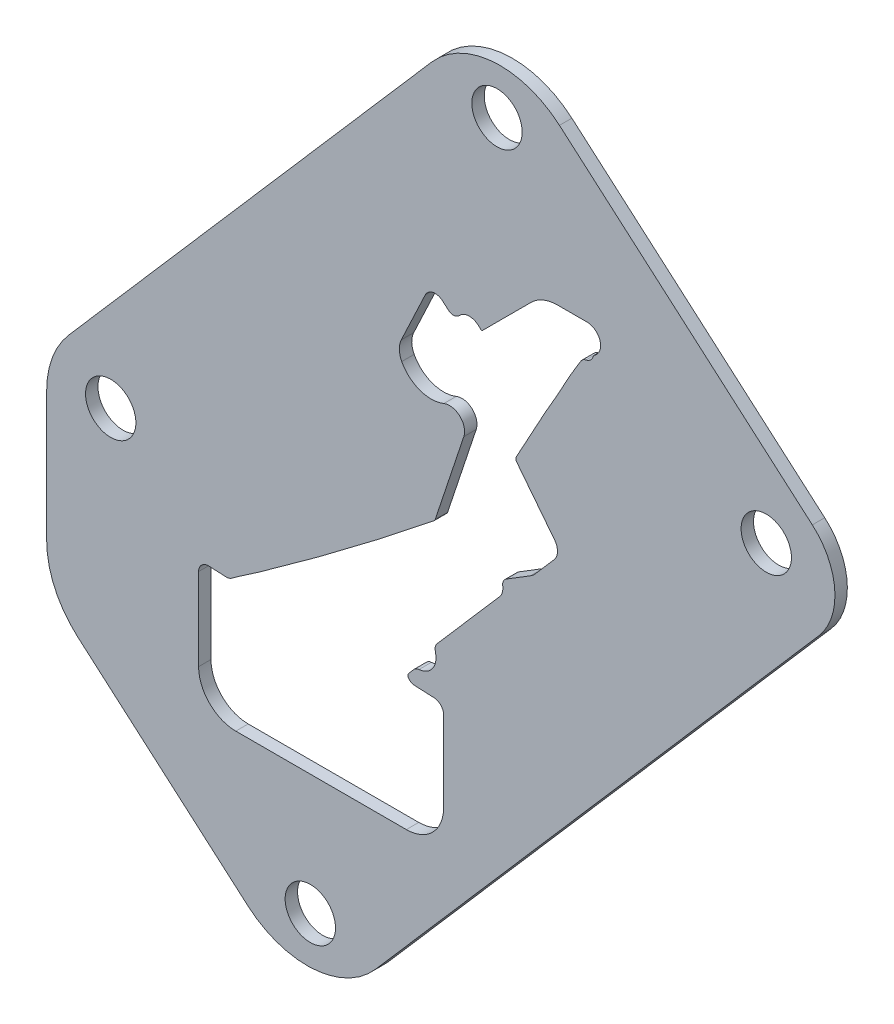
from build123d import *

# Parameters (mm, degrees)
BOSS_EXTRUDE1_DEPTH                            = 2.54
HOLE1_D                                        = 10.3124
CUT_EXTRUDE1_QU250515L_PUNCH26_MOUNTED_I_DEPTH = 456.267668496
FILLET1_R                                      = 1.5875
FILLET2_R                                      = 0.79375


with BuildPart() as part:
    # Sketch2 → Boss-Extrude1 (new body)
    with BuildSketch(Plane.XY.offset(-29.21)):
        with BuildLine():
            Line((-277.670813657, -6.122873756), (-329.450777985, 38.844355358))
            ThreePointArc((-329.450777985, 38.844355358), (-342.911048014, 43.340785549), (-355.608352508, 37.002393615))
            Line((-355.608352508, 37.002393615), (-429.924768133, -48.573289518))
            ThreePointArc((-429.924768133, -48.573289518), (-433.294361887, -54.241794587), (-434.467, -60.731095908))
            Line((-434.467, -60.731095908), (-434.467, -87.232348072))
            ThreePointArc((-434.467, -87.232348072), (-432.795622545, -94.925712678), (-428.08280639, -101.232116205))
            Line((-428.08280639, -101.232116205), (-393.258258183, -131.474768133))
            ThreePointArc((-393.258258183, -131.474768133), (-379.797988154, -135.971198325), (-367.10068366, -129.63280639))
            Line((-367.10068366, -129.63280639), (-276.333498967, -25.113989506))
            ThreePointArc((-276.333498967, -25.113989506), (-273.068967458, -15.34146469), (-277.670813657, -6.122873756))
        make_face()
    extrude(amount=-BOSS_EXTRUDE1_DEPTH)

    # Hole1 (through all)
    with Locations(Plane(origin=(-324.575695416, -14.460479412, -29.21), x_dir=(1, 0, 0), z_dir=(0, 0, 1))):
        with Locations((-17.663697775, 48.263140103), (37.472375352, 0.381368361), (-55.893947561, -111.972594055), (-96.772711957, -42.831241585)):
            Hole(HOLE1_D / 2)

    # Sketch1 QU250515L_Punch26_Mounted in the → Cut-Extrude1 QU250515L_Punch26_Mounted i (cut, through all)
    with BuildSketch(Plane.XY.offset(-29.21)):
        with BuildLine():
            Line((-323.821484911, 6.778771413), (-329.866864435, 6.778771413))
            ThreePointArc((-329.866864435, 6.778771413), (-332.78291219, 6.19873345), (-335.255018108, 4.546925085))
            Line((-335.255018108, 4.546925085), (-345.215586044, -5.413642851))
            ThreePointArc((-345.215586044, -5.413642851), (-345.395191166, -5.488037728), (-345.574796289, -5.413642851))
            Line((-345.574796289, -5.413642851), (-345.934006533, -5.054432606))
            ThreePointArc((-345.934006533, -5.054432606), (-348.787119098, -4.377447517), (-350.673739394, -6.622269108))
            Line((-350.673739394, -6.622269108), (-353.407010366, -4.24861699))
            ThreePointArc((-353.407010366, -4.24861699), (-355.364066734, -3.741437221), (-356.949396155, -4.996041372))
            Line((-356.949396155, -4.996041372), (-361.837583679, -15.384297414))
            ThreePointArc((-361.837583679, -15.384297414), (-362.242427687, -17.300618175), (-361.748332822, -19.195889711))
            ThreePointArc((-361.748332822, -19.195889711), (-358.039982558, -22.424186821), (-353.124227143, -22.328726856))
            ThreePointArc((-353.124227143, -22.328726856), (-349.856493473, -22.93175598), (-349.038318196, -26.152364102))
            Line((-349.038318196, -26.152364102), (-354.89302927, -43.761492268))
            ThreePointArc((-354.89302927, -43.761492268), (-354.985978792, -43.947326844), (-355.127519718, -44.099446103))
            ThreePointArc((-355.127519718, -44.099446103), (-372.805833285, -57.892237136), (-390.917601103, -71.110698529))
            Line((-390.917601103, -71.110698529), (-394.79394731, -73.76324236))
            ThreePointArc((-394.79394731, -73.76324236), (-395.699416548, -74.404443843), (-396.603513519, -75.047578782))
            ThreePointArc((-396.603513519, -75.047578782), (-397.133844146, -75.305564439), (-397.719388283, -75.375886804))
            Line((-397.719388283, -75.375886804), (-401.224344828, -75.210709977))
            ThreePointArc((-401.224344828, -75.210709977), (-402.722614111, -75.770185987), (-403.352, -77.240457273))
            Line((-403.352, -77.240457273), (-403.352, -94.107))
            ThreePointArc((-403.352, -94.107), (-401.120153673, -99.495153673), (-395.732, -101.727))
            Line((-395.732, -101.727), (-360.807, -101.727))
            ThreePointArc((-360.807, -101.727), (-355.418846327, -99.495153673), (-353.187, -94.107))
            Line((-353.187, -94.107), (-353.187, -77.539711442))
            ThreePointArc((-353.187, -77.539711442), (-353.748728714, -76.13709733), (-355.123344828, -75.509964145))
            Line((-355.123344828, -75.509964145), (-359.690046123, -75.294750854))
            Line((-359.690046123, -75.294750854), (-360.803075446, -74.328163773))
            Line((-360.803075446, -74.328163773), (-358.817373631, -72.041621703))
            ThreePointArc((-358.817373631, -72.041621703), (-355.791659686, -70.898544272), (-354.765382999, -67.831244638))
            Line((-354.765382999, -67.831244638), (-354.822446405, -67.359859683))
            ThreePointArc((-354.822446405, -67.359859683), (-354.928120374, -66.820436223), (-355.111111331, -66.302112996))
            Line((-355.111111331, -66.302112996), (-341.724092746, -50.886898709))
            ThreePointArc((-341.724092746, -50.886898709), (-341.055395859, -49.351137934), (-341.385232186, -47.708906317))
            Line((-341.385232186, -47.708906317), (-335.420274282, -44.028615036))
            ThreePointArc((-335.420274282, -44.028615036), (-334.876281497, -43.633200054), (-334.398168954, -43.160241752))
            Line((-334.398168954, -43.160241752), (-330.541734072, -38.719539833))
            ThreePointArc((-330.541734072, -38.719539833), (-329.858210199, -36.959315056), (-330.450427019, -35.166307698))
            Line((-330.450427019, -35.166307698), (-338.24577182, -25.198765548))
            ThreePointArc((-338.24577182, -25.198765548), (-338.398298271, -24.808731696), (-338.311367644, -24.399056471))
            Line((-338.311367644, -24.399056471), (-332.466908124, -13.701521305))
            Line((-332.466908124, -13.701521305), (-329.884539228, -9.204578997))
            Line((-329.884539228, -9.204578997), (-327.710288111, -5.224890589))
            ThreePointArc((-327.710288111, -5.224890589), (-327.498770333, -4.846173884), (-327.285490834, -4.468446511))
            ThreePointArc((-327.285490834, -4.468446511), (-327.06690102, -4.094805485), (-326.843935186, -3.723759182))
            ThreePointArc((-326.843935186, -3.723759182), (-325.754794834, -1.898952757), (-324.6361989, -0.092052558))
            ThreePointArc((-324.6361989, -0.092052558), (-324.573174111, -0.078041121), (-324.508627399, -0.076569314))
            ThreePointArc((-324.508627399, -0.076569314), (-323.410084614, 0.18465492), (-322.66546519, 1.033522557))
            ThreePointArc((-322.66546519, 1.033522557), (-322.565757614, 1.260559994), (-322.464972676, 1.487121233))
            ThreePointArc((-322.464972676, 1.487121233), (-322.423803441, 1.551158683), (-322.365506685, 1.600119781))
            ThreePointArc((-322.365506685, 1.600119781), (-321.131768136, 4.74098545), (-323.821484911, 6.778771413))
        make_face()
    extrude(amount=-CUT_EXTRUDE1_QU250515L_PUNCH26_MOUNTED_I_DEPTH, mode=Mode.SUBTRACT)

    # Fillet1
    fillet1_edges = [part.edges().sort_by_distance(p)[0] for p in [
        (-355.111111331, -66.302112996, -30.48),
        (-324.6361989, -0.092052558, -30.48),
        (-350.673739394, -6.622269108, -30.48),
        (-341.385232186, -47.708906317, -30.48),
        (-358.817373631, -72.041621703, -30.48),
        (-359.690046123, -75.294750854, -30.48),
    ]]
    fillet(fillet1_edges, radius=FILLET1_R)

    # Fillet2
    fillet2_edges = [part.edges().sort_by_distance(p)[0] for p in [
        (-360.803075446, -74.328163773, -30.48),
    ]]
    fillet(fillet2_edges, radius=FILLET2_R)


solid = part.part
